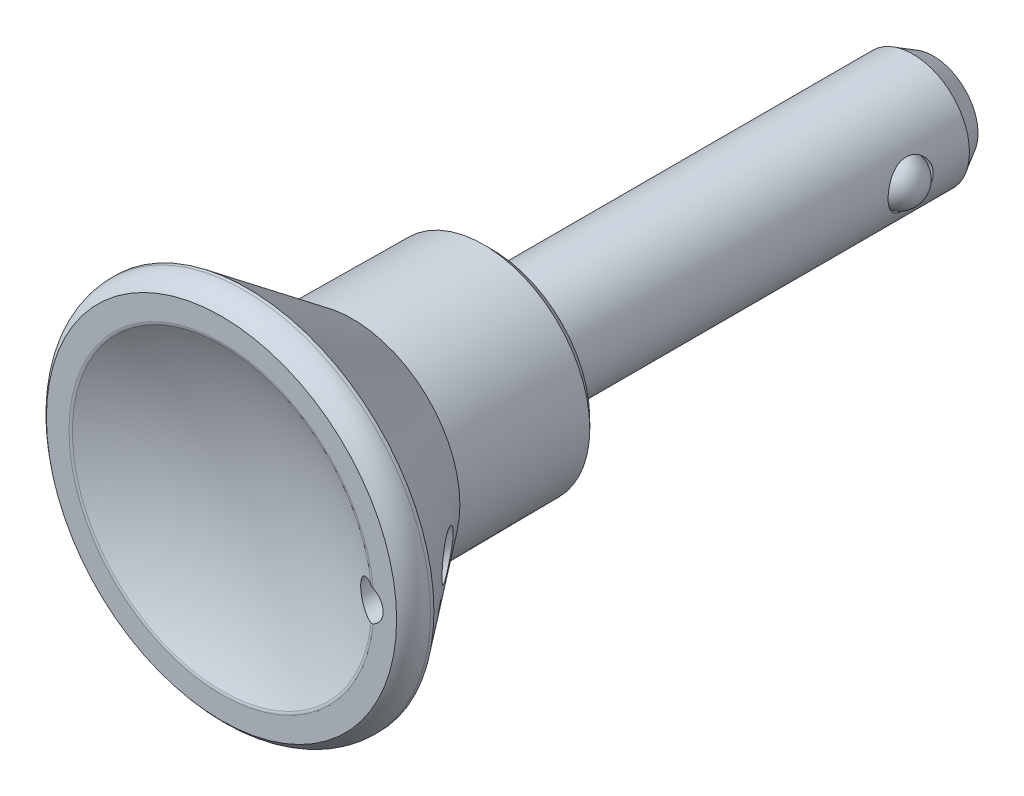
ISO-10303-21;
HEADER;
FILE_DESCRIPTION(('STEP AP214'),'2;1');
FILE_NAME('part.step','',(''),(''),'','','');
FILE_SCHEMA(('AUTOMOTIVE_DESIGN { 1 0 10303 214 1 1 1 1 }'));
ENDSEC;
DATA;
#1=APPLICATION_CONTEXT('core data for automotive mechanical design processes');
#2=APPLICATION_PROTOCOL_DEFINITION('international standard','automotive_design',2000,#1);
#3=PRODUCT_CONTEXT('',#1,'mechanical');
#4=PRODUCT('Part','Part','',(#3));
#5=PRODUCT_RELATED_PRODUCT_CATEGORY('part','',(#4));
#6=PRODUCT_DEFINITION_FORMATION('','',#4);
#7=PRODUCT_DEFINITION_CONTEXT('part definition',#1,'design');
#8=PRODUCT_DEFINITION('design','',#6,#7);
#9=PRODUCT_DEFINITION_SHAPE('','',#8);
#10=(LENGTH_UNIT() NAMED_UNIT(*) SI_UNIT(.MILLI.,.METRE.));
#11=(NAMED_UNIT(*) PLANE_ANGLE_UNIT() SI_UNIT($,.RADIAN.));
#12=(NAMED_UNIT(*) SI_UNIT($,.STERADIAN.) SOLID_ANGLE_UNIT());
#13=UNCERTAINTY_MEASURE_WITH_UNIT(LENGTH_MEASURE(1.E-05),#10,'distance_accuracy_value','');
#14=(GEOMETRIC_REPRESENTATION_CONTEXT(3) GLOBAL_UNCERTAINTY_ASSIGNED_CONTEXT((#13)) GLOBAL_UNIT_ASSIGNED_CONTEXT((#10,
#11,#12)) REPRESENTATION_CONTEXT('',''));
#15=CARTESIAN_POINT('',(0.,0.,0.));
#16=DIRECTION('',(0.,0.,1.));
#17=DIRECTION('',(1.,0.,0.));
#18=AXIS2_PLACEMENT_3D('',#15,#16,#17);
#19=CARTESIAN_POINT('',(0.,0.,23.5));
#20=DIRECTION('',(0.,0.,1.));
#21=DIRECTION('',(0.,-1.,0.));
#22=AXIS2_PLACEMENT_3D('',#19,#20,#21);
#23=TOROIDAL_SURFACE('',#22,13.499629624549,0.50000000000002);
#24=CARTESIAN_POINT('',(13.1832697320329,1.45020836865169,23.940350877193));
#25=CARTESIAN_POINT('',(13.1967898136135,1.44663630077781,23.9473693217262));
#26=CARTESIAN_POINT('',(13.2105528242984,1.44279517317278,23.9537540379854));
#27=CARTESIAN_POINT('',(13.2384329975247,1.43456873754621,23.9652617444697));
#28=CARTESIAN_POINT('',(13.2525500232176,1.43018363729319,23.9703852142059));
#29=CARTESIAN_POINT('',(13.294658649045,1.41639274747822,23.9836925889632));
#30=CARTESIAN_POINT('',(13.322980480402,1.40620303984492,23.9901034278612));
#31=CARTESIAN_POINT('',(13.3645007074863,1.38980064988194,23.9961744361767));
#32=CARTESIAN_POINT('',(13.377775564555,1.38433480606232,23.9976116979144));
#33=CARTESIAN_POINT('',(13.4043485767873,1.37294329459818,23.9995283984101));
#34=CARTESIAN_POINT('',(13.4176457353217,1.3670137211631,23.999998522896));
#35=CARTESIAN_POINT('',(13.430859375,1.3608881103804,24.));
#36=B_SPLINE_CURVE_WITH_KNOTS('',3,(#24,#25,#26,#27,#28,#29,#30,#31,#32,#33,#34,#35),
.UNSPECIFIED.,.F.,.F.,(4,2,2,2,2,4),(0.,0.046898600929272,0.0937793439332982,0.185591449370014,
0.228845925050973,0.272515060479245),.UNSPECIFIED.);
#37=CARTESIAN_POINT('',(13.1832697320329,1.45020836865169,23.940350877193));
#38=VERTEX_POINT('',#37);
#39=CARTESIAN_POINT('',(13.430859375,1.36088811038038,24.));
#40=VERTEX_POINT('',#39);
#41=EDGE_CURVE('E57',#38,#40,#36,.T.);
#42=ORIENTED_EDGE('',*,*,#41,.T.);
#43=CARTESIAN_POINT('',(0.,0.,24.));
#44=DIRECTION('',(0.,0.,1.));
#45=DIRECTION('',(0.,-1.,0.));
#46=AXIS2_PLACEMENT_3D('',#43,#44,#45);
#47=CIRCLE('',#46,13.499629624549);
#48=CARTESIAN_POINT('',(13.430859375,-1.36088811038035,24.));
#49=VERTEX_POINT('',#48);
#50=EDGE_CURVE('E37',#49,#40,#47,.F.);
#51=ORIENTED_EDGE('',*,*,#50,.F.);
#52=CARTESIAN_POINT('',(13.430859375,-1.36088811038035,24.));
#53=CARTESIAN_POINT('',(13.4166665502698,-1.36746807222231,23.9999984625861));
#54=CARTESIAN_POINT('',(13.4023759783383,-1.37382175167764,23.9994558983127));
#55=CARTESIAN_POINT('',(13.3736641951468,-1.38605678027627,23.9972288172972));
#56=CARTESIAN_POINT('',(13.3592428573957,-1.39193760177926,23.9955430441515));
#57=CARTESIAN_POINT('',(13.316571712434,-1.4085689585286,23.9887845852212));
#58=CARTESIAN_POINT('',(13.2882736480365,-1.41860415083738,23.9820148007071));
#59=CARTESIAN_POINT('',(13.2473798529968,-1.43179699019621,23.9685266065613));
#60=CARTESIAN_POINT('',(13.2344037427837,-1.43578270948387,23.9636790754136));
#61=CARTESIAN_POINT('',(13.2086362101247,-1.44332889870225,23.9528611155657));
#62=CARTESIAN_POINT('',(13.1958479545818,-1.44688469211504,23.9468798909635));
#63=CARTESIAN_POINT('',(13.1832697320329,-1.45020836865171,23.940350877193));
#64=B_SPLINE_CURVE_WITH_KNOTS('',3,(#52,#53,#54,#55,#56,#57,#58,#59,#60,#61,#62,#63),
.UNSPECIFIED.,.F.,.F.,(4,2,2,2,2,4),(0.,0.0469051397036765,0.093861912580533,0.185680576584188,
0.228880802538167,0.2725152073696),.UNSPECIFIED.);
#65=CARTESIAN_POINT('',(13.1832697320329,-1.4502083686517,23.940350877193));
#66=VERTEX_POINT('',#65);
#67=EDGE_CURVE('E19',#49,#66,#64,.T.);
#68=ORIENTED_EDGE('',*,*,#67,.T.);
#69=CARTESIAN_POINT('',(0.,0.,23.940350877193));
#70=DIRECTION('',(0.,0.,1.));
#71=DIRECTION('',(0.,-1.,0.));
#72=AXIS2_PLACEMENT_3D('',#69,#70,#71);
#73=CIRCLE('',#72,13.2627940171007);
#74=EDGE_CURVE('E52',#38,#66,#73,.T.);
#75=ORIENTED_EDGE('',*,*,#74,.F.);
#76=EDGE_LOOP('',(#42,#51,#68,#75));
#77=FACE_BOUND('',#76,.T.);
#78=ADVANCED_FACE('F14',(#77),#23,.T.);
#79=CARTESIAN_POINT('',(0.,0.,48.6));
#80=DIRECTION('',(0.,-1.,0.));
#81=DIRECTION('',(0.,0.,1.));
#82=AXIS2_PLACEMENT_3D('',#79,#80,#81);
#83=SPHERICAL_SURFACE('',#82,28.);
#84=CARTESIAN_POINT('',(13.1832697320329,1.45020836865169,23.940350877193));
#85=CARTESIAN_POINT('',(13.0915993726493,1.4744532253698,23.8927620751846));
#86=CARTESIAN_POINT('',(12.9980560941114,1.489860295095,23.8443501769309));
#87=CARTESIAN_POINT('',(12.8097591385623,1.50293318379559,23.7471842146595));
#88=CARTESIAN_POINT('',(12.7150040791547,1.50057651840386,23.6984297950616));
#89=CARTESIAN_POINT('',(12.5270201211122,1.47798913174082,23.6019874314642));
#90=CARTESIAN_POINT('',(12.4337919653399,1.45774995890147,23.5543000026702));
#91=CARTESIAN_POINT('',(12.2517517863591,1.39948117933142,23.4614379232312));
#92=CARTESIAN_POINT('',(12.1629377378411,1.36145981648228,23.416262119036));
#93=CARTESIAN_POINT('',(11.9952411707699,1.26934990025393,23.3311736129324));
#94=CARTESIAN_POINT('',(11.9161458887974,1.21575714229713,23.2911465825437));
#95=CARTESIAN_POINT('',(11.7681643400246,1.09295087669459,23.2164149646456));
#96=CARTESIAN_POINT('',(11.6992729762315,1.02374521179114,23.1817077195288));
#97=CARTESIAN_POINT('',(11.5811025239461,0.878735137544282,23.1222729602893));
#98=CARTESIAN_POINT('',(11.5305709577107,0.804216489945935,23.0969048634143));
#99=CARTESIAN_POINT('',(11.4431131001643,0.645771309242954,23.0530473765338));
#100=CARTESIAN_POINT('',(11.4061726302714,0.561854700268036,23.0345508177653));
#101=CARTESIAN_POINT('',(11.3518094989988,0.398913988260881,23.0073479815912));
#102=CARTESIAN_POINT('',(11.332464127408,0.320688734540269,22.9976766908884));
#103=CARTESIAN_POINT('',(11.3065630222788,0.161638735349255,22.9847305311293));
#104=CARTESIAN_POINT('',(11.3000015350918,0.0808151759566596,22.9814527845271));
#105=CARTESIAN_POINT('',(11.2999985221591,-0.0778011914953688,22.9814513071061));
#106=CARTESIAN_POINT('',(11.3060768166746,-0.155594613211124,22.9844877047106));
#107=CARTESIAN_POINT('',(11.3300927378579,-0.308850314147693,22.9964912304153));
#108=CARTESIAN_POINT('',(11.3480306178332,-0.384312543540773,23.0054584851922));
#109=CARTESIAN_POINT('',(11.3948947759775,-0.530632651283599,23.0289063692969));
#110=CARTESIAN_POINT('',(11.4237977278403,-0.601499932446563,23.0433752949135));
#111=CARTESIAN_POINT('',(11.4913996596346,-0.737094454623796,23.0772561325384));
#112=CARTESIAN_POINT('',(11.5301003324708,-0.801820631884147,23.0966688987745));
#113=CARTESIAN_POINT('',(11.6176766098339,-0.9263609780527,23.1406602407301));
#114=CARTESIAN_POINT('',(11.6669073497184,-0.98586052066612,23.1654195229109));
#115=CARTESIAN_POINT('',(11.7728262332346,-1.09578522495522,23.2187793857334));
#116=CARTESIAN_POINT('',(11.8295165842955,-1.14620769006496,23.2473811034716));
#117=CARTESIAN_POINT('',(11.9547131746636,-1.24189507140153,23.3106654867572));
#118=CARTESIAN_POINT('',(12.0238340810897,-1.28614058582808,23.3456702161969));
#119=CARTESIAN_POINT('',(12.1672246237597,-1.36242212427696,23.4184517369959));
#120=CARTESIAN_POINT('',(12.2414976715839,-1.39444996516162,23.4562303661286));
#121=CARTESIAN_POINT('',(12.3592920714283,-1.4344825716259,23.5162885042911));
#122=CARTESIAN_POINT('',(12.4017101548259,-1.44682505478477,23.5379430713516));
#123=CARTESIAN_POINT('',(12.4872184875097,-1.4676864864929,23.5816530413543));
#124=CARTESIAN_POINT('',(12.5303081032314,-1.47620883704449,23.603708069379));
#125=CARTESIAN_POINT('',(12.6602504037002,-1.49604024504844,23.6703078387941));
#126=CARTESIAN_POINT('',(12.7478240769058,-1.50162964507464,23.7153114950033));
#127=CARTESIAN_POINT('',(12.8938293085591,-1.49821627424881,23.7905484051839));
#128=CARTESIAN_POINT('',(12.9524047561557,-1.49339577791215,23.8207882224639));
#129=CARTESIAN_POINT('',(13.0686394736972,-1.47691090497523,23.8809033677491));
#130=CARTESIAN_POINT('',(13.1263001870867,-1.46525870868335,23.9107792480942));
#131=CARTESIAN_POINT('',(13.1832697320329,-1.4502083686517,23.9403508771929));
#132=B_SPLINE_CURVE_WITH_KNOTS('',3,(#84,#85,#86,#87,#88,#89,#90,#91,#92,#93,#94,#95,#96,#97,
#98,#99,#100,#101,#102,#103,#104,#105,#106,#107,#108,#109,#110,#111,#112,#113,#114,#115,#116,
#117,#118,#119,#120,#121,#122,#123,#124,#125,#126,#127,#128,#129,#130,#131),.UNSPECIFIED.,.F.,
.F.,(4,2,2,2,2,2,2,2,2,2,2,2,2,2,2,2,2,2,2,2,2,2,2,4),(0.,0.317865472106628,0.636133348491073,
0.954551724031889,1.27282262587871,1.58190076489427,1.89082399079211,2.16986616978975,
2.44861641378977,2.69085568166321,2.93298589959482,3.16608592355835,3.39919092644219,
3.63180279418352,3.8644548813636,4.10674626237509,4.34910950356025,4.61569988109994,
4.88246850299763,5.02992533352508,5.17725058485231,5.4717357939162,5.66970066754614,
5.86731365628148),.UNSPECIFIED.);
#133=EDGE_CURVE('E48',#38,#66,#132,.T.);
#134=ORIENTED_EDGE('',*,*,#133,.F.);
#135=ORIENTED_EDGE('',*,*,#74,.T.);
#136=EDGE_LOOP('',(#134,#135));
#137=FACE_BOUND('',#136,.T.);
#138=ADVANCED_FACE('F50',(#137),#83,.F.);
#139=CARTESIAN_POINT('',(-15.81,-15.5,24.));
#140=CARTESIAN_POINT('',(-15.5,-15.5,24.));
#141=CARTESIAN_POINT('',(15.5,-15.5,24.));
#142=B_SPLINE_CURVE_WITH_KNOTS('',1,(#139,#140,#141),.UNSPECIFIED.,.F.,.F.,(2,1,2),(-0.01,0.,
1.),.UNSPECIFIED.);
#143=DIRECTION('',(0.,1.,0.));
#144=VECTOR('',#143,1.);
#145=SURFACE_OF_LINEAR_EXTRUSION('',#142,#144);
#146=CARTESIAN_POINT('',(12.8,0.,24.));
#147=DIRECTION('',(0.,0.,1.));
#148=DIRECTION('',(0.,-1.,0.));
#149=AXIS2_PLACEMENT_3D('',#146,#147,#148);
#150=CIRCLE('',#149,1.5);
#151=EDGE_CURVE('E54',#49,#40,#150,.T.);
#152=ORIENTED_EDGE('',*,*,#151,.F.);
#153=ORIENTED_EDGE('',*,*,#50,.T.);
#154=EDGE_LOOP('',(#152,#153));
#155=FACE_BOUND('',#154,.T.);
#156=CARTESIAN_POINT('',(0.,0.,24.));
#157=DIRECTION('',(0.,0.,1.));
#158=DIRECTION('',(0.,-1.,0.));
#159=AXIS2_PLACEMENT_3D('',#156,#157,#158);
#160=CIRCLE('',#159,15.5);
#161=CARTESIAN_POINT('',(0.,-15.5,24.));
#162=VERTEX_POINT('',#161);
#163=EDGE_CURVE('E55',#162,#162,#160,.F.);
#164=ORIENTED_EDGE('',*,*,#163,.F.);
#165=EDGE_LOOP('',(#164));
#166=FACE_BOUND('',#165,.T.);
#167=ADVANCED_FACE('F179',(#155,#166),#145,.T.);
#168=CARTESIAN_POINT('',(0.,0.,22.));
#169=DIRECTION('',(0.,0.,1.));
#170=DIRECTION('',(0.,-1.,0.));
#171=AXIS2_PLACEMENT_3D('',#168,#169,#170);
#172=TOROIDAL_SURFACE('',#171,14.,2.5);
#173=ORIENTED_EDGE('',*,*,#163,.T.);
#174=EDGE_LOOP('',(#173));
#175=FACE_BOUND('',#174,.T.);
#176=CARTESIAN_POINT('',(0.,0.,22.));
#177=DIRECTION('',(0.,0.,1.));
#178=DIRECTION('',(1.,0.,0.));
#179=AXIS2_PLACEMENT_3D('',#176,#177,#178);
#180=CIRCLE('',#179,16.5);
#181=CARTESIAN_POINT('',(16.5,0.,22.));
#182=VERTEX_POINT('',#181);
#183=EDGE_CURVE('E93',#182,#182,#180,.F.);
#184=ORIENTED_EDGE('',*,*,#183,.F.);
#185=EDGE_LOOP('',(#184));
#186=FACE_BOUND('',#185,.T.);
#187=ADVANCED_FACE('F72',(#175,#186),#172,.T.);
#188=CARTESIAN_POINT('',(12.8,0.,14.7910576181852));
#189=DIRECTION('',(0.,0.,1.));
#190=DIRECTION('',(0.,-1.,0.));
#191=AXIS2_PLACEMENT_3D('',#188,#189,#190);
#192=CYLINDRICAL_SURFACE('',#191,1.5);
#193=CARTESIAN_POINT('',(12.62421875,-1.48966471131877,16.6671130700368));
#194=CARTESIAN_POINT('',(12.6920032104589,-1.49766166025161,16.7577945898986));
#195=CARTESIAN_POINT('',(12.7603283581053,-1.50104579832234,16.8484671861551));
#196=CARTESIAN_POINT('',(12.897645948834,-1.49839397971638,17.0292601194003));
#197=CARTESIAN_POINT('',(12.9666387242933,-1.49235306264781,17.1193801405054));
#198=CARTESIAN_POINT('',(13.1046564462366,-1.47039580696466,17.2982798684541));
#199=CARTESIAN_POINT('',(13.1736813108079,-1.45448817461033,17.3870606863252));
#200=CARTESIAN_POINT('',(13.3110827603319,-1.41207641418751,17.5624849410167));
#201=CARTESIAN_POINT('',(13.3794598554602,-1.38558148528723,17.6491301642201));
#202=CARTESIAN_POINT('',(13.5187485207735,-1.31898430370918,17.8243946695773));
#203=CARTESIAN_POINT('',(13.5895656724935,-1.27816038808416,17.9128199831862));
#204=CARTESIAN_POINT('',(13.7277317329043,-1.18169522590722,18.084148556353));
#205=CARTESIAN_POINT('',(13.7950853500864,-1.12607476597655,18.1670593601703));
#206=CARTESIAN_POINT('',(13.9084086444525,-1.01303116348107,18.3057043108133));
#207=CARTESIAN_POINT('',(13.9556726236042,-0.959133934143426,18.3632332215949));
#208=CARTESIAN_POINT('',(14.0446143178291,-0.840483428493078,18.471045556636));
#209=CARTESIAN_POINT('',(14.0863013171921,-0.775748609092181,18.5213410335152));
#210=CARTESIAN_POINT('',(14.1507925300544,-0.654717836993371,18.5988956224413));
#211=CARTESIAN_POINT('',(14.1756178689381,-0.601120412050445,18.6286642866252));
#212=CARTESIAN_POINT('',(14.2195452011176,-0.488403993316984,18.6812412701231));
#213=CARTESIAN_POINT('',(14.238652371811,-0.429290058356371,18.7040558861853));
#214=CARTESIAN_POINT('',(14.2689681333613,-0.309460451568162,18.7402118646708));
#215=CARTESIAN_POINT('',(14.2805052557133,-0.248950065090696,18.7539474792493));
#216=CARTESIAN_POINT('',(14.2960184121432,-0.12562551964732,18.77240966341));
#217=CARTESIAN_POINT('',(14.3000000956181,-0.0628131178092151,18.7771429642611));
#218=CARTESIAN_POINT('',(14.2999999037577,0.0632231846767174,18.7771427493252));
#219=CARTESIAN_POINT('',(14.2959658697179,0.126447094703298,18.7723472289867));
#220=CARTESIAN_POINT('',(14.2802519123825,0.250551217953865,18.7536458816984));
#221=CARTESIAN_POINT('',(14.2685662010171,0.311429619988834,18.7397331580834));
#222=CARTESIAN_POINT('',(14.2387365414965,0.428564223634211,18.7041556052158));
#223=CARTESIAN_POINT('',(14.2206451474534,0.484853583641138,18.6825538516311));
#224=CARTESIAN_POINT('',(14.1792492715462,0.592453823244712,18.633014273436));
#225=CARTESIAN_POINT('',(14.1559422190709,0.643762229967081,18.6050733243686));
#226=CARTESIAN_POINT('',(14.0931329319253,0.764461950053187,18.5295741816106));
#227=CARTESIAN_POINT('',(14.0512237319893,0.830727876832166,18.4790335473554));
#228=CARTESIAN_POINT('',(13.9615408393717,0.952125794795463,18.370367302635));
#229=CARTESIAN_POINT('',(13.9137529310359,1.00722990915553,18.3122232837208));
#230=CARTESIAN_POINT('',(13.7883270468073,1.13348006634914,18.1588182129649));
#231=CARTESIAN_POINT('',(13.708179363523,1.1978805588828,18.0600849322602));
#232=CARTESIAN_POINT('',(13.5435609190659,1.3064664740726,17.8554996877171));
#233=CARTESIAN_POINT('',(13.4590828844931,1.35061655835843,17.7496356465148));
#234=CARTESIAN_POINT('',(13.3107013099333,1.41202717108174,17.5619635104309));
#235=CARTESIAN_POINT('',(13.2471965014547,1.43330058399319,17.4811068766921));
#236=CARTESIAN_POINT('',(13.1198264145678,1.46698834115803,17.3177942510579));
#237=CARTESIAN_POINT('',(13.0559609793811,1.47939847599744,17.2353375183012));
#238=CARTESIAN_POINT('',(12.9282718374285,1.49589397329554,17.0692879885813));
#239=CARTESIAN_POINT('',(12.8644485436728,1.49996064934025,16.9856930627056));
#240=CARTESIAN_POINT('',(12.7374091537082,1.5000387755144,16.8180712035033));
#241=CARTESIAN_POINT('',(12.6741929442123,1.49605175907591,16.7340443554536));
#242=CARTESIAN_POINT('',(12.5469978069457,1.47993658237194,16.5637117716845));
#243=CARTESIAN_POINT('',(12.4830456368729,1.46758777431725,16.4774068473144));
#244=CARTESIAN_POINT('',(12.3565302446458,1.43443826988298,16.3053467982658));
#245=CARTESIAN_POINT('',(12.2939675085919,1.41363466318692,16.2195918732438));
#246=CARTESIAN_POINT('',(12.1709555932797,1.36334219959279,16.0496685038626));
#247=CARTESIAN_POINT('',(12.1104987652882,1.33388949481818,15.9654949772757));
#248=CARTESIAN_POINT('',(11.9920388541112,1.26565016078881,15.7992974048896));
#249=CARTESIAN_POINT('',(11.9340336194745,1.2268719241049,15.7172714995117));
#250=CARTESIAN_POINT('',(11.8266654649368,1.14315320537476,15.5643050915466));
#251=CARTESIAN_POINT('',(11.7770073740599,1.09916121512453,15.4930561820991));
#252=CARTESIAN_POINT('',(11.6811267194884,1.0014126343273,15.3545942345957));
#253=CARTESIAN_POINT('',(11.6349116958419,0.947635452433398,15.2873901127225));
#254=CARTESIAN_POINT('',(11.5691423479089,0.858125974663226,15.1911821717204));
#255=CARTESIAN_POINT('',(11.5476572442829,0.826531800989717,15.1596504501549));
#256=CARTESIAN_POINT('',(11.5063433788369,0.760253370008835,15.0988444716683));
#257=CARTESIAN_POINT('',(11.4865152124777,0.725568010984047,15.0695710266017));
#258=CARTESIAN_POINT('',(11.4302732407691,0.616814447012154,14.9863165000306));
#259=CARTESIAN_POINT('',(11.3967954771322,0.537651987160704,14.9364517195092));
#260=CARTESIAN_POINT('',(11.3555291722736,0.407099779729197,14.8747804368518));
#261=CARTESIAN_POINT('',(11.3430899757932,0.360365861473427,14.856144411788));
#262=CARTESIAN_POINT('',(11.3225831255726,0.263914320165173,14.8253840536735));
#263=CARTESIAN_POINT('',(11.3145046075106,0.214204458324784,14.8132435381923));
#264=CARTESIAN_POINT('',(11.3059949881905,0.136701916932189,14.8004485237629));
#265=CARTESIAN_POINT('',(11.3037543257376,0.109528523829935,14.7970776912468));
#266=CARTESIAN_POINT('',(11.300755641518,0.0549082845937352,14.7925658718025));
#267=CARTESIAN_POINT('',(11.2999979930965,0.0274613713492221,14.791425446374));
#268=CARTESIAN_POINT('',(11.3000036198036,-0.0495314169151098,14.7914342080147));
#269=CARTESIAN_POINT('',(11.3024785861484,-0.0991098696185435,14.7951600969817));
#270=CARTESIAN_POINT('',(11.3121472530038,-0.196763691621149,14.8096998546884));
#271=CARTESIAN_POINT('',(11.3193489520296,-0.244836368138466,14.8205257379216));
#272=CARTESIAN_POINT('',(11.3399096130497,-0.348584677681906,14.851379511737));
#273=CARTESIAN_POINT('',(11.3542736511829,-0.403610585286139,14.8729064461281));
#274=CARTESIAN_POINT('',(11.387815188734,-0.50871821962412,14.9230284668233));
#275=CARTESIAN_POINT('',(11.4070004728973,-0.558791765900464,14.9516349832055));
#276=CARTESIAN_POINT('',(11.4595328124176,-0.677671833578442,15.0296959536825));
#277=CARTESIAN_POINT('',(11.4951602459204,-0.74330038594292,15.0824162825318));
#278=CARTESIAN_POINT('',(11.5718624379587,-0.864190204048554,15.1952386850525));
#279=CARTESIAN_POINT('',(11.6129512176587,-0.919423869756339,15.2553597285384));
#280=CARTESIAN_POINT('',(11.6921657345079,-1.01283475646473,15.3705343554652));
#281=CARTESIAN_POINT('',(11.7297508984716,-1.05232856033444,15.4249113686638));
#282=CARTESIAN_POINT('',(11.8070065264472,-1.12552131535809,15.5360737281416));
#283=CARTESIAN_POINT('',(11.8466784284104,-1.15921620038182,15.5928607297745));
#284=CARTESIAN_POINT('',(11.9276586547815,-1.22132048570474,15.7081342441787));
#285=CARTESIAN_POINT('',(11.9689673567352,-1.24972865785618,15.7666211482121));
#286=CARTESIAN_POINT('',(12.0529136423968,-1.30165144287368,15.884812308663));
#287=CARTESIAN_POINT('',(12.0955516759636,-1.32516437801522,15.9445169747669));
#288=CARTESIAN_POINT('',(12.2167649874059,-1.38470455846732,16.1132939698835));
#289=CARTESIAN_POINT('',(12.2965837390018,-1.41552588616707,16.2233378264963));
#290=CARTESIAN_POINT('',(12.458735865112,-1.46310486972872,16.4446295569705));
#291=CARTESIAN_POINT('',(12.5410705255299,-1.47985520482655,16.5558780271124));
#292=CARTESIAN_POINT('',(12.62421875,-1.48966471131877,16.6671130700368));
#293=B_SPLINE_CURVE_WITH_KNOTS('',3,(#193,#194,#195,#196,#197,#198,#199,#200,#201,#202,#203,
#204,#205,#206,#207,#208,#209,#210,#211,#212,#213,#214,#215,#216,#217,#218,#219,#220,#221,#222,
#223,#224,#225,#226,#227,#228,#229,#230,#231,#232,#233,#234,#235,#236,#237,#238,#239,#240,#241,
#242,#243,#244,#245,#246,#247,#248,#249,#250,#251,#252,#253,#254,#255,#256,#257,#258,#259,#260,
#261,#262,#263,#264,#265,#266,#267,#268,#269,#270,#271,#272,#273,#274,#275,#276,#277,#278,#279,
#280,#281,#282,#283,#284,#285,#286,#287,#288,#289,#290,#291,#292),.UNSPECIFIED.,.T.,.F.,(4,2,2,
2,2,2,2,2,2,2,2,2,2,2,2,2,2,2,2,2,2,2,2,2,2,2,2,2,2,2,2,2,2,2,2,2,2,2,2,2,2,2,2,2,2,2,2,2,2,4),
(0.,0.3403810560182,0.680941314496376,1.02120149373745,1.36116666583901,1.72154948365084,
2.08142867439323,2.35634247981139,2.63079277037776,2.82853330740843,3.02609425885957,
3.21438583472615,3.40253656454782,3.59191561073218,3.78143807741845,3.96944036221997,
4.15753551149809,4.43581804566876,4.71478725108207,5.14007838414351,5.56610888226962,
5.88069336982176,6.19542716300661,6.51086508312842,6.82624294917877,7.15028500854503,
7.47443870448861,7.79725631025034,8.11978447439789,8.41136093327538,8.70355821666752,
8.8520054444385,9.00050579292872,9.29551066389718,9.45047012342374,9.60504170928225,
9.68734372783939,9.76966646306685,9.91815000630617,10.0668854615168,10.2482950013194,
10.4299993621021,10.702706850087,10.9761285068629,11.2068168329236,11.4376662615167,
11.6685692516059,11.8995512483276,12.3168647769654,12.7343952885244),.UNSPECIFIED.);
#294=CARTESIAN_POINT('',(12.62421875,-1.48966471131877,16.6671130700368));
#295=VERTEX_POINT('',#294);
#296=EDGE_CURVE('E86',#295,#295,#293,.T.);
#297=ORIENTED_EDGE('',*,*,#296,.F.);
#298=EDGE_LOOP('',(#297));
#299=FACE_BOUND('',#298,.T.);
#300=ORIENTED_EDGE('',*,*,#67,.F.);
#301=ORIENTED_EDGE('',*,*,#151,.T.);
#302=ORIENTED_EDGE('',*,*,#41,.F.);
#303=ORIENTED_EDGE('',*,*,#133,.T.);
#304=EDGE_LOOP('',(#300,#301,#302,#303));
#305=FACE_BOUND('',#304,.T.);
#306=ADVANCED_FACE('F58',(#299,#305),#192,.F.);
#307=CARTESIAN_POINT('',(0.,0.,22.));
#308=DIRECTION('',(0.,0.,1.));
#309=DIRECTION('',(0.,-1.,0.));
#310=AXIS2_PLACEMENT_3D('',#307,#308,#309);
#311=CYLINDRICAL_SURFACE('',#310,16.5);
#312=ORIENTED_EDGE('',*,*,#183,.T.);
#313=EDGE_LOOP('',(#312));
#314=FACE_BOUND('',#313,.T.);
#315=CARTESIAN_POINT('',(0.,0.,21.7));
#316=DIRECTION('',(0.,0.,-1.));
#317=DIRECTION('',(1.,0.,0.));
#318=AXIS2_PLACEMENT_3D('',#315,#316,#317);
#319=CIRCLE('',#318,16.5);
#320=CARTESIAN_POINT('',(16.5,0.,21.7));
#321=VERTEX_POINT('',#320);
#322=EDGE_CURVE('E92',#321,#321,#319,.T.);
#323=ORIENTED_EDGE('',*,*,#322,.F.);
#324=EDGE_LOOP('',(#323));
#325=FACE_BOUND('',#324,.T.);
#326=ADVANCED_FACE('F71',(#314,#325),#311,.T.);
#327=CARTESIAN_POINT('',(0.,0.,12.4));
#328=DIRECTION('',(0.,0.,1.));
#329=DIRECTION('',(0.,-1.,0.));
#330=AXIS2_PLACEMENT_3D('',#327,#328,#329);
#331=CONICAL_SURFACE('',#330,9.5,0.645219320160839);
#332=ORIENTED_EDGE('',*,*,#296,.T.);
#333=EDGE_LOOP('',(#332));
#334=FACE_BOUND('',#333,.T.);
#335=ORIENTED_EDGE('',*,*,#322,.T.);
#336=EDGE_LOOP('',(#335));
#337=FACE_BOUND('',#336,.T.);
#338=CARTESIAN_POINT('',(0.,0.,12.4));
#339=DIRECTION('',(0.,0.,-1.));
#340=DIRECTION('',(1.,0.,0.));
#341=AXIS2_PLACEMENT_3D('',#338,#339,#340);
#342=CIRCLE('',#341,9.5);
#343=CARTESIAN_POINT('',(9.5,0.,12.4));
#344=VERTEX_POINT('',#343);
#345=EDGE_CURVE('E163',#344,#344,#342,.T.);
#346=ORIENTED_EDGE('',*,*,#345,.F.);
#347=EDGE_LOOP('',(#346));
#348=FACE_BOUND('',#347,.T.);
#349=ADVANCED_FACE('F94',(#334,#337,#348),#331,.T.);
#350=CARTESIAN_POINT('',(0.,0.,0.799969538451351));
#351=DIRECTION('',(0.,0.,1.));
#352=DIRECTION('',(0.,-1.,0.));
#353=AXIS2_PLACEMENT_3D('',#350,#351,#352);
#354=CONICAL_SURFACE('',#353,9.39876806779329,0.00872664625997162);
#355=ORIENTED_EDGE('',*,*,#345,.T.);
#356=EDGE_LOOP('',(#355));
#357=FACE_BOUND('',#356,.T.);
#358=CARTESIAN_POINT('',(0.,0.,0.799969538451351));
#359=DIRECTION('',(0.,0.,-1.));
#360=DIRECTION('',(1.,0.,0.));
#361=AXIS2_PLACEMENT_3D('',#358,#359,#360);
#362=CIRCLE('',#361,9.39876806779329);
#363=CARTESIAN_POINT('',(9.39876806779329,0.,0.799969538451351));
#364=VERTEX_POINT('',#363);
#365=EDGE_CURVE('E160',#364,#364,#362,.T.);
#366=ORIENTED_EDGE('',*,*,#365,.F.);
#367=EDGE_LOOP('',(#366));
#368=FACE_BOUND('',#367,.T.);
#369=ADVANCED_FACE('F98',(#357,#368),#354,.T.);
#370=CARTESIAN_POINT('',(0.,0.,0.));
#371=DIRECTION('',(0.,0.,1.));
#372=DIRECTION('',(0.,-1.,0.));
#373=AXIS2_PLACEMENT_3D('',#370,#371,#372);
#374=CONICAL_SURFACE('',#373,8.59178683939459,0.789761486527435);
#375=ORIENTED_EDGE('',*,*,#365,.T.);
#376=EDGE_LOOP('',(#375));
#377=FACE_BOUND('',#376,.T.);
#378=CARTESIAN_POINT('',(0.,0.,0.));
#379=DIRECTION('',(0.,0.,1.));
#380=DIRECTION('',(0.,-1.,0.));
#381=AXIS2_PLACEMENT_3D('',#378,#379,#380);
#382=CIRCLE('',#381,8.59178683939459);
#383=CARTESIAN_POINT('',(0.,-8.59178683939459,0.));
#384=VERTEX_POINT('',#383);
#385=EDGE_CURVE('E30',#384,#384,#382,.F.);
#386=ORIENTED_EDGE('',*,*,#385,.F.);
#387=EDGE_LOOP('',(#386));
#388=FACE_BOUND('',#387,.T.);
#389=ADVANCED_FACE('F102',(#377,#388),#374,.T.);
#390=CARTESIAN_POINT('',(8.5917868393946,-8.69489038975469,0.));
#391=DIRECTION('',(0.,0.,-1.));
#392=DIRECTION('',(-1.,0.,0.));
#393=AXIS2_PLACEMENT_3D('',#390,#391,#392);
#394=PLANE('',#393);
#395=CARTESIAN_POINT('',(0.,0.,0.));
#396=DIRECTION('',(0.,0.,1.));
#397=DIRECTION('',(0.,-1.,0.));
#398=AXIS2_PLACEMENT_3D('',#395,#396,#397);
#399=CIRCLE('',#398,5.);
#400=CARTESIAN_POINT('',(0.,-5.,0.));
#401=VERTEX_POINT('',#400);
#402=EDGE_CURVE('E9',#401,#401,#399,.F.);
#403=ORIENTED_EDGE('',*,*,#402,.F.);
#404=EDGE_LOOP('',(#403));
#405=FACE_BOUND('',#404,.T.);
#406=ORIENTED_EDGE('',*,*,#385,.T.);
#407=EDGE_LOOP('',(#406));
#408=FACE_BOUND('',#407,.T.);
#409=ADVANCED_FACE('F106',(#405,#408),#394,.T.);
#410=CARTESIAN_POINT('',(0.,0.,0.));
#411=DIRECTION('',(0.,0.,1.));
#412=DIRECTION('',(0.,-1.,0.));
#413=AXIS2_PLACEMENT_3D('',#410,#411,#412);
#414=CYLINDRICAL_SURFACE('',#413,5.);
#415=ORIENTED_EDGE('',*,*,#402,.T.);
#416=EDGE_LOOP('',(#415));
#417=FACE_BOUND('',#416,.T.);
#418=CARTESIAN_POINT('',(5.,0.,-30.));
#419=CARTESIAN_POINT('',(4.99999504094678,0.107615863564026,-30.0000062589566));
#420=CARTESIAN_POINT('',(4.99648897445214,0.215325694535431,-30.0087281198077));
#421=CARTESIAN_POINT('',(4.98282088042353,0.427616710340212,-30.0432818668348));
#422=CARTESIAN_POINT('',(4.97264930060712,0.532193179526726,-30.0691383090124));
#423=CARTESIAN_POINT('',(4.94674442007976,0.734940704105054,-30.1368701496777));
#424=CARTESIAN_POINT('',(4.93102668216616,0.83312878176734,-30.1787007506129));
#425=CARTESIAN_POINT('',(4.89557266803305,1.02104090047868,-30.2770003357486));
#426=CARTESIAN_POINT('',(4.87583644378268,1.11076505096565,-30.3334691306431));
#427=CARTESIAN_POINT('',(4.83330802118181,1.2835047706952,-30.4622380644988));
#428=CARTESIAN_POINT('',(4.8104211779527,1.36606882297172,-30.5351123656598));
#429=CARTESIAN_POINT('',(4.76460397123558,1.51818036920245,-30.6934066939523));
#430=CARTESIAN_POINT('',(4.74167359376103,1.58772251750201,-30.7788318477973));
#431=CARTESIAN_POINT('',(4.69722807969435,1.71487412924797,-30.9644273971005));
#432=CARTESIAN_POINT('',(4.67582146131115,1.77181418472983,-31.0650850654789));
#433=CARTESIAN_POINT('',(4.63833669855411,1.86775416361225,-31.2755348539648));
#434=CARTESIAN_POINT('',(4.62225609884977,1.90676235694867,-31.3853227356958));
#435=CARTESIAN_POINT('',(4.59826357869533,1.96389881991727,-31.6057123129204));
#436=CARTESIAN_POINT('',(4.59001420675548,1.98289395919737,-31.7160511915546));
#437=CARTESIAN_POINT('',(4.58164004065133,2.00217296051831,-31.9386349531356));
#438=CARTESIAN_POINT('',(4.5815112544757,2.0024660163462,-32.0508788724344));
#439=CARTESIAN_POINT('',(4.58910500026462,1.98498937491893,-32.2657566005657));
#440=CARTESIAN_POINT('',(4.59628174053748,1.96847534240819,-32.3685155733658));
#441=CARTESIAN_POINT('',(4.61676185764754,1.91994691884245,-32.5696594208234));
#442=CARTESIAN_POINT('',(4.63006631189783,1.88792980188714,-32.6680435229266));
#443=CARTESIAN_POINT('',(4.66159517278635,1.80869394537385,-32.8600197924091));
#444=CARTESIAN_POINT('',(4.67991453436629,1.7611780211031,-32.9534730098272));
#445=CARTESIAN_POINT('',(4.71938201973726,1.65250390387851,-33.1314192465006));
#446=CARTESIAN_POINT('',(4.74053109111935,1.59134113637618,-33.2159092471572));
#447=CARTESIAN_POINT('',(4.78526406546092,1.45156124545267,-33.3803975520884));
#448=CARTESIAN_POINT('',(4.80890991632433,1.37196139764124,-33.4595460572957));
#449=CARTESIAN_POINT('',(4.8545919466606,1.20033946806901,-33.6036660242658));
#450=CARTESIAN_POINT('',(4.87662734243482,1.10831139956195,-33.6686306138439));
#451=CARTESIAN_POINT('',(4.91716230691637,0.91200742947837,-33.7836609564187));
#452=CARTESIAN_POINT('',(4.93558065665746,0.807520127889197,-33.8333960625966));
#453=CARTESIAN_POINT('',(4.96616672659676,0.590835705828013,-33.9142166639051));
#454=CARTESIAN_POINT('',(4.97834697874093,0.478654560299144,-33.9453395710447));
#455=CARTESIAN_POINT('',(4.99108567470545,0.304486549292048,-33.9776312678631));
#456=CARTESIAN_POINT('',(4.99441629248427,0.243952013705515,-33.9860060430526));
#457=CARTESIAN_POINT('',(4.99887485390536,0.122288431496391,-33.9971921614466));
#458=CARTESIAN_POINT('',(5.00000281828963,0.0611593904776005,-34.0000035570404));
#459=CARTESIAN_POINT('',(4.99999504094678,-0.107615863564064,-33.9999937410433));
#460=CARTESIAN_POINT('',(4.99648897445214,-0.215325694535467,-33.9912718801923));
#461=CARTESIAN_POINT('',(4.98282088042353,-0.427616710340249,-33.9567181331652));
#462=CARTESIAN_POINT('',(4.97264930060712,-0.532193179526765,-33.9308616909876));
#463=CARTESIAN_POINT('',(4.94674442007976,-0.734940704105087,-33.8631298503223));
#464=CARTESIAN_POINT('',(4.93102668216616,-0.833128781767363,-33.8212992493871));
#465=CARTESIAN_POINT('',(4.89557266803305,-1.0210409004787,-33.7229996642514));
#466=CARTESIAN_POINT('',(4.87583644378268,-1.11076505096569,-33.6665308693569));
#467=CARTESIAN_POINT('',(4.83330802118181,-1.28350477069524,-33.5377619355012));
#468=CARTESIAN_POINT('',(4.81042117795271,-1.36606882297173,-33.4648876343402));
#469=CARTESIAN_POINT('',(4.76460397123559,-1.51818036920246,-33.3065933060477));
#470=CARTESIAN_POINT('',(4.74167359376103,-1.58772251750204,-33.2211681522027));
#471=CARTESIAN_POINT('',(4.69722807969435,-1.71487412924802,-33.0355726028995));
#472=CARTESIAN_POINT('',(4.67582146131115,-1.77181418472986,-32.9349149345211));
#473=CARTESIAN_POINT('',(4.63833669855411,-1.86775416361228,-32.7244651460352));
#474=CARTESIAN_POINT('',(4.62225609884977,-1.90676235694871,-32.6146772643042));
#475=CARTESIAN_POINT('',(4.59826357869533,-1.96389881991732,-32.3942876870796));
#476=CARTESIAN_POINT('',(4.59001420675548,-1.98289395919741,-32.2839488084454));
#477=CARTESIAN_POINT('',(4.58164004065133,-2.00217296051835,-32.0613650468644));
#478=CARTESIAN_POINT('',(4.5815112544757,-2.00246601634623,-31.9491211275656));
#479=CARTESIAN_POINT('',(4.58910500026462,-1.98498937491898,-31.7342433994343));
#480=CARTESIAN_POINT('',(4.59628174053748,-1.96847534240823,-31.6314844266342));
#481=CARTESIAN_POINT('',(4.61676185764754,-1.91994691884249,-31.4303405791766));
#482=CARTESIAN_POINT('',(4.63006631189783,-1.88792980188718,-31.3319564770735));
#483=CARTESIAN_POINT('',(4.66159517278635,-1.8086939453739,-31.1399802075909));
#484=CARTESIAN_POINT('',(4.67991453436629,-1.76117802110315,-31.0465269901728));
#485=CARTESIAN_POINT('',(4.71938201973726,-1.65250390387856,-30.8685807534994));
#486=CARTESIAN_POINT('',(4.74053109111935,-1.59134113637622,-30.7840907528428));
#487=CARTESIAN_POINT('',(4.78526406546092,-1.45156124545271,-30.6196024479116));
#488=CARTESIAN_POINT('',(4.80890991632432,-1.37196139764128,-30.5404539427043));
#489=CARTESIAN_POINT('',(4.8545919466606,-1.20033946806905,-30.3963339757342));
#490=CARTESIAN_POINT('',(4.87662734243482,-1.10831139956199,-30.3313693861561));
#491=CARTESIAN_POINT('',(4.91716230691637,-0.912007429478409,-30.2163390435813));
#492=CARTESIAN_POINT('',(4.93558065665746,-0.807520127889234,-30.1666039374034));
#493=CARTESIAN_POINT('',(4.96616672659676,-0.590835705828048,-30.0857833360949));
#494=CARTESIAN_POINT('',(4.97834697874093,-0.47865456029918,-30.0546604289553));
#495=CARTESIAN_POINT('',(4.99108567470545,-0.304486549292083,-30.0223687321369));
#496=CARTESIAN_POINT('',(4.99441629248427,-0.24395201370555,-30.0139939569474));
#497=CARTESIAN_POINT('',(4.99887485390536,-0.122288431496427,-30.0028078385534));
#498=CARTESIAN_POINT('',(5.00000281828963,-0.0611593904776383,-29.9999964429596));
#499=CARTESIAN_POINT('',(5.,0.,-30.));
#500=B_SPLINE_CURVE_WITH_KNOTS('',3,(#418,#419,#420,#421,#422,#423,#424,#425,#426,#427,#428,
#429,#430,#431,#432,#433,#434,#435,#436,#437,#438,#439,#440,#441,#442,#443,#444,#445,#446,#447,
#448,#449,#450,#451,#452,#453,#454,#455,#456,#457,#458,#459,#460,#461,#462,#463,#464,#465,#466,
#467,#468,#469,#470,#471,#472,#473,#474,#475,#476,#477,#478,#479,#480,#481,#482,#483,#484,#485,
#486,#487,#488,#489,#490,#491,#492,#493,#494,#495,#496,#497,#498,#499),.UNSPECIFIED.,.T.,.F.,(4,
2,2,2,2,2,2,2,2,2,2,2,2,2,2,2,2,2,2,2,2,2,2,2,2,2,2,2,2,2,2,2,2,2,2,2,2,2,2,2,4),(0.,
0.322610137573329,0.645683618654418,0.967857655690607,1.2900275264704,1.62598692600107,
1.96208394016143,2.31315011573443,2.66405422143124,2.99904097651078,3.33386305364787,
3.6453830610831,3.95695786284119,4.27489766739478,4.59294420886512,4.93553475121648,
5.27829091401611,5.62803295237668,5.9770695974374,6.16041454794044,6.34375777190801,
6.66636790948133,6.98944139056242,7.3116154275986,7.63378529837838,7.96974469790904,
8.30584171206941,8.65690788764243,9.00781199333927,9.34279874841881,9.6776208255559,
9.9891408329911,10.3007156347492,10.6186554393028,10.9367019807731,11.2792925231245,
11.6220486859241,11.9717907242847,12.3208273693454,12.5041723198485,12.687515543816),.UNSPECIFIED.);
#501=CARTESIAN_POINT('',(5.,0.,-30.));
#502=VERTEX_POINT('',#501);
#503=EDGE_CURVE('E123',#502,#502,#500,.T.);
#504=ORIENTED_EDGE('',*,*,#503,.T.);
#505=EDGE_LOOP('',(#504));
#506=FACE_BOUND('',#505,.T.);
#507=CARTESIAN_POINT('',(-5.,0.,-30.));
#508=CARTESIAN_POINT('',(-4.99999504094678,0.107615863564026,-30.0000062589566));
#509=CARTESIAN_POINT('',(-4.99648897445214,0.215325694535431,-30.0087281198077));
#510=CARTESIAN_POINT('',(-4.98282088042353,0.427616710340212,-30.0432818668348));
#511=CARTESIAN_POINT('',(-4.97264930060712,0.532193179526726,-30.0691383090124));
#512=CARTESIAN_POINT('',(-4.94674442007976,0.734940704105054,-30.1368701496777));
#513=CARTESIAN_POINT('',(-4.93102668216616,0.83312878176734,-30.1787007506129));
#514=CARTESIAN_POINT('',(-4.89557266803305,1.02104090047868,-30.2770003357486));
#515=CARTESIAN_POINT('',(-4.87583644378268,1.11076505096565,-30.3334691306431));
#516=CARTESIAN_POINT('',(-4.83330802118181,1.2835047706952,-30.4622380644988));
#517=CARTESIAN_POINT('',(-4.8104211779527,1.36606882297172,-30.5351123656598));
#518=CARTESIAN_POINT('',(-4.76460397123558,1.51818036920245,-30.6934066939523));
#519=CARTESIAN_POINT('',(-4.74167359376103,1.58772251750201,-30.7788318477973));
#520=CARTESIAN_POINT('',(-4.69722807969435,1.71487412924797,-30.9644273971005));
#521=CARTESIAN_POINT('',(-4.67582146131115,1.77181418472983,-31.0650850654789));
#522=CARTESIAN_POINT('',(-4.63833669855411,1.86775416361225,-31.2755348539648));
#523=CARTESIAN_POINT('',(-4.62225609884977,1.90676235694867,-31.3853227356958));
#524=CARTESIAN_POINT('',(-4.59826357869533,1.96389881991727,-31.6057123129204));
#525=CARTESIAN_POINT('',(-4.59001420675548,1.98289395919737,-31.7160511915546));
#526=CARTESIAN_POINT('',(-4.58164004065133,2.00217296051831,-31.9386349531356));
#527=CARTESIAN_POINT('',(-4.5815112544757,2.0024660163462,-32.0508788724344));
#528=CARTESIAN_POINT('',(-4.58910500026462,1.98498937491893,-32.2657566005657));
#529=CARTESIAN_POINT('',(-4.59628174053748,1.96847534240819,-32.3685155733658));
#530=CARTESIAN_POINT('',(-4.61676185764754,1.91994691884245,-32.5696594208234));
#531=CARTESIAN_POINT('',(-4.63006631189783,1.88792980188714,-32.6680435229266));
#532=CARTESIAN_POINT('',(-4.66159517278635,1.80869394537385,-32.8600197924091));
#533=CARTESIAN_POINT('',(-4.67991453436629,1.7611780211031,-32.9534730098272));
#534=CARTESIAN_POINT('',(-4.71938201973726,1.65250390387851,-33.1314192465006));
#535=CARTESIAN_POINT('',(-4.74053109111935,1.59134113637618,-33.2159092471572));
#536=CARTESIAN_POINT('',(-4.78526406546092,1.45156124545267,-33.3803975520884));
#537=CARTESIAN_POINT('',(-4.80890991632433,1.37196139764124,-33.4595460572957));
#538=CARTESIAN_POINT('',(-4.8545919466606,1.20033946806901,-33.6036660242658));
#539=CARTESIAN_POINT('',(-4.87662734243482,1.10831139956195,-33.6686306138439));
#540=CARTESIAN_POINT('',(-4.91716230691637,0.91200742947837,-33.7836609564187));
#541=CARTESIAN_POINT('',(-4.93558065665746,0.807520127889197,-33.8333960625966));
#542=CARTESIAN_POINT('',(-4.96616672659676,0.590835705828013,-33.9142166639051));
#543=CARTESIAN_POINT('',(-4.97834697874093,0.478654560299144,-33.9453395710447));
#544=CARTESIAN_POINT('',(-4.99108567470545,0.304486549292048,-33.9776312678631));
#545=CARTESIAN_POINT('',(-4.99441629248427,0.243952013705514,-33.9860060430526));
#546=CARTESIAN_POINT('',(-4.99887485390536,0.122288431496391,-33.9971921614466));
#547=CARTESIAN_POINT('',(-5.00000281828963,0.061159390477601,-34.0000035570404));
#548=CARTESIAN_POINT('',(-4.99999504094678,-0.107615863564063,-33.9999937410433));
#549=CARTESIAN_POINT('',(-4.99648897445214,-0.215325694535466,-33.9912718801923));
#550=CARTESIAN_POINT('',(-4.98282088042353,-0.427616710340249,-33.9567181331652));
#551=CARTESIAN_POINT('',(-4.97264930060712,-0.532193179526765,-33.9308616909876));
#552=CARTESIAN_POINT('',(-4.94674442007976,-0.734940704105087,-33.8631298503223));
#553=CARTESIAN_POINT('',(-4.93102668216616,-0.833128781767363,-33.8212992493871));
#554=CARTESIAN_POINT('',(-4.89557266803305,-1.0210409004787,-33.7229996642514));
#555=CARTESIAN_POINT('',(-4.87583644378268,-1.11076505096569,-33.6665308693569));
#556=CARTESIAN_POINT('',(-4.83330802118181,-1.28350477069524,-33.5377619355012));
#557=CARTESIAN_POINT('',(-4.81042117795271,-1.36606882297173,-33.4648876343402));
#558=CARTESIAN_POINT('',(-4.76460397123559,-1.51818036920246,-33.3065933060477));
#559=CARTESIAN_POINT('',(-4.74167359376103,-1.58772251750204,-33.2211681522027));
#560=CARTESIAN_POINT('',(-4.69722807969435,-1.71487412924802,-33.0355726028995));
#561=CARTESIAN_POINT('',(-4.67582146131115,-1.77181418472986,-32.9349149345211));
#562=CARTESIAN_POINT('',(-4.63833669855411,-1.86775416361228,-32.7244651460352));
#563=CARTESIAN_POINT('',(-4.62225609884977,-1.9067623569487,-32.6146772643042));
#564=CARTESIAN_POINT('',(-4.59826357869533,-1.96389881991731,-32.3942876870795));
#565=CARTESIAN_POINT('',(-4.59001420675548,-1.98289395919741,-32.2839488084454));
#566=CARTESIAN_POINT('',(-4.58164004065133,-2.00217296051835,-32.0613650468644));
#567=CARTESIAN_POINT('',(-4.5815112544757,-2.00246601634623,-31.9491211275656));
#568=CARTESIAN_POINT('',(-4.58910500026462,-1.98498937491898,-31.7342433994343));
#569=CARTESIAN_POINT('',(-4.59628174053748,-1.96847534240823,-31.6314844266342));
#570=CARTESIAN_POINT('',(-4.61676185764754,-1.91994691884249,-31.4303405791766));
#571=CARTESIAN_POINT('',(-4.63006631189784,-1.88792980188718,-31.3319564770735));
#572=CARTESIAN_POINT('',(-4.66159517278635,-1.8086939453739,-31.1399802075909));
#573=CARTESIAN_POINT('',(-4.67991453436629,-1.76117802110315,-31.0465269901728));
#574=CARTESIAN_POINT('',(-4.71938201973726,-1.65250390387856,-30.8685807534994));
#575=CARTESIAN_POINT('',(-4.74053109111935,-1.59134113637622,-30.7840907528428));
#576=CARTESIAN_POINT('',(-4.78526406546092,-1.45156124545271,-30.6196024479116));
#577=CARTESIAN_POINT('',(-4.80890991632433,-1.37196139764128,-30.5404539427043));
#578=CARTESIAN_POINT('',(-4.8545919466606,-1.20033946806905,-30.3963339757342));
#579=CARTESIAN_POINT('',(-4.87662734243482,-1.10831139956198,-30.3313693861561));
#580=CARTESIAN_POINT('',(-4.91716230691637,-0.912007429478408,-30.2163390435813));
#581=CARTESIAN_POINT('',(-4.93558065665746,-0.807520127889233,-30.1666039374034));
#582=CARTESIAN_POINT('',(-4.96616672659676,-0.590835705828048,-30.0857833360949));
#583=CARTESIAN_POINT('',(-4.97834697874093,-0.478654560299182,-30.0546604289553));
#584=CARTESIAN_POINT('',(-4.99108567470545,-0.304486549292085,-30.0223687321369));
#585=CARTESIAN_POINT('',(-4.99441629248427,-0.243952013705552,-30.0139939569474));
#586=CARTESIAN_POINT('',(-4.99887485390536,-0.122288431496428,-30.0028078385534));
#587=CARTESIAN_POINT('',(-5.00000281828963,-0.0611593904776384,-29.9999964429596));
#588=CARTESIAN_POINT('',(-5.,0.,-30.));
#589=B_SPLINE_CURVE_WITH_KNOTS('',3,(#507,#508,#509,#510,#511,#512,#513,#514,#515,#516,#517,
#518,#519,#520,#521,#522,#523,#524,#525,#526,#527,#528,#529,#530,#531,#532,#533,#534,#535,#536,
#537,#538,#539,#540,#541,#542,#543,#544,#545,#546,#547,#548,#549,#550,#551,#552,#553,#554,#555,
#556,#557,#558,#559,#560,#561,#562,#563,#564,#565,#566,#567,#568,#569,#570,#571,#572,#573,#574,
#575,#576,#577,#578,#579,#580,#581,#582,#583,#584,#585,#586,#587,#588),.UNSPECIFIED.,.T.,.F.,(4,
2,2,2,2,2,2,2,2,2,2,2,2,2,2,2,2,2,2,2,2,2,2,2,2,2,2,2,2,2,2,2,2,2,2,2,2,2,2,2,4),(0.,
0.322610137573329,0.645683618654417,0.967857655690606,1.2900275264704,1.62598692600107,
1.96208394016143,2.31315011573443,2.66405422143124,2.99904097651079,3.33386305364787,
3.6453830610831,3.95695786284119,4.27489766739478,4.59294420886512,4.93553475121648,
5.27829091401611,5.62803295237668,5.9770695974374,6.16041454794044,6.34375777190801,
6.66636790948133,6.98944139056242,7.3116154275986,7.63378529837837,7.96974469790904,
8.30584171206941,8.65690788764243,9.00781199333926,9.34279874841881,9.6776208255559,
9.9891408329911,10.3007156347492,10.6186554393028,10.9367019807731,11.2792925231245,
11.6220486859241,11.9717907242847,12.3208273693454,12.5041723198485,12.687515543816),.UNSPECIFIED.);
#590=CARTESIAN_POINT('',(-5.,0.,-30.));
#591=VERTEX_POINT('',#590);
#592=EDGE_CURVE('E131',#591,#591,#589,.T.);
#593=ORIENTED_EDGE('',*,*,#592,.F.);
#594=EDGE_LOOP('',(#593));
#595=FACE_BOUND('',#594,.T.);
#596=CARTESIAN_POINT('',(0.,0.,-37.2));
#597=DIRECTION('',(0.,0.,1.));
#598=DIRECTION('',(1.,0.,0.));
#599=AXIS2_PLACEMENT_3D('',#596,#597,#598);
#600=CIRCLE('',#599,5.);
#601=CARTESIAN_POINT('',(5.,0.,-37.2));
#602=VERTEX_POINT('',#601);
#603=EDGE_CURVE('E140',#602,#602,#600,.T.);
#604=ORIENTED_EDGE('',*,*,#603,.T.);
#605=EDGE_LOOP('',(#604));
#606=FACE_BOUND('',#605,.T.);
#607=ADVANCED_FACE('F110',(#417,#506,#595,#606),#414,.T.);
#608=CARTESIAN_POINT('',(3.96076951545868,-4.00830085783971,-39.));
#609=DIRECTION('',(0.,0.,-1.));
#610=DIRECTION('',(-1.,0.,0.));
#611=AXIS2_PLACEMENT_3D('',#608,#609,#610);
#612=PLANE('',#611);
#613=CARTESIAN_POINT('',(0.,0.,-39.));
#614=DIRECTION('',(0.,0.,1.));
#615=DIRECTION('',(0.,-1.,0.));
#616=AXIS2_PLACEMENT_3D('',#613,#614,#615);
#617=CIRCLE('',#616,3.96076951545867);
#618=CARTESIAN_POINT('',(0.,-3.96076951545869,-39.));
#619=VERTEX_POINT('',#618);
#620=EDGE_CURVE('E315',#619,#619,#617,.T.);
#621=ORIENTED_EDGE('',*,*,#620,.F.);
#622=EDGE_LOOP('',(#621));
#623=FACE_BOUND('',#622,.T.);
#624=ADVANCED_FACE('F114',(#623),#612,.T.);
#625=CARTESIAN_POINT('',(-3.99,0.,-32.));
#626=DIRECTION('',(0.,-1.,0.));
#627=DIRECTION('',(0.,0.,-1.));
#628=AXIS2_PLACEMENT_3D('',#625,#626,#627);
#629=SPHERICAL_SURFACE('',#628,2.01);
#630=CARTESIAN_POINT('',(-4.19024984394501,0.,-32.));
#631=DIRECTION('',(1.,0.,0.));
#632=DIRECTION('',(0.,-1.,0.));
#633=AXIS2_PLACEMENT_3D('',#630,#631,#632);
#634=CIRCLE('',#633,2.);
#635=CARTESIAN_POINT('',(-4.19024984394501,-2.00000000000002,-32.));
#636=VERTEX_POINT('',#635);
#637=EDGE_CURVE('E137',#636,#636,#634,.T.);
#638=ORIENTED_EDGE('',*,*,#637,.F.);
#639=EDGE_LOOP('',(#638));
#640=FACE_BOUND('',#639,.T.);
#641=ADVANCED_FACE('F148',(#640),#629,.T.);
#642=CARTESIAN_POINT('',(3.99,0.,-32.));
#643=DIRECTION('',(0.,-1.,0.));
#644=DIRECTION('',(0.,0.,-1.));
#645=AXIS2_PLACEMENT_3D('',#642,#643,#644);
#646=SPHERICAL_SURFACE('',#645,2.01);
#647=CARTESIAN_POINT('',(4.19024984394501,0.,-32.));
#648=DIRECTION('',(1.,0.,0.));
#649=DIRECTION('',(0.,-1.,0.));
#650=AXIS2_PLACEMENT_3D('',#647,#648,#649);
#651=CIRCLE('',#650,2.);
#652=CARTESIAN_POINT('',(4.19024984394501,-2.00000000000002,-32.));
#653=VERTEX_POINT('',#652);
#654=EDGE_CURVE('E311',#653,#653,#651,.F.);
#655=ORIENTED_EDGE('',*,*,#654,.F.);
#656=EDGE_LOOP('',(#655));
#657=FACE_BOUND('',#656,.T.);
#658=ADVANCED_FACE('F143',(#657),#646,.T.);
#659=CARTESIAN_POINT('',(0.,0.,-39.));
#660=DIRECTION('',(0.,0.,1.));
#661=DIRECTION('',(0.,-1.,0.));
#662=AXIS2_PLACEMENT_3D('',#659,#660,#661);
#663=CONICAL_SURFACE('',#662,3.96076951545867,0.5235987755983);
#664=ORIENTED_EDGE('',*,*,#620,.T.);
#665=EDGE_LOOP('',(#664));
#666=FACE_BOUND('',#665,.T.);
#667=ORIENTED_EDGE('',*,*,#603,.F.);
#668=EDGE_LOOP('',(#667));
#669=FACE_BOUND('',#668,.T.);
#670=ADVANCED_FACE('F147',(#666,#669),#663,.T.);
#671=CARTESIAN_POINT('',(-5.00013884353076,0.,-32.));
#672=DIRECTION('',(1.,0.,0.));
#673=DIRECTION('',(0.,-1.,0.));
#674=AXIS2_PLACEMENT_3D('',#671,#672,#673);
#675=CYLINDRICAL_SURFACE('',#674,2.);
#676=ORIENTED_EDGE('',*,*,#592,.T.);
#677=EDGE_LOOP('',(#676));
#678=FACE_BOUND('',#677,.T.);
#679=ORIENTED_EDGE('',*,*,#637,.T.);
#680=EDGE_LOOP('',(#679));
#681=FACE_BOUND('',#680,.T.);
#682=ADVANCED_FACE('F118',(#678,#681),#675,.F.);
#683=CARTESIAN_POINT('',(4.19024984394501,0.,-32.));
#684=DIRECTION('',(1.,0.,0.));
#685=DIRECTION('',(0.,-1.,0.));
#686=AXIS2_PLACEMENT_3D('',#683,#684,#685);
#687=CYLINDRICAL_SURFACE('',#686,2.);
#688=ORIENTED_EDGE('',*,*,#654,.T.);
#689=EDGE_LOOP('',(#688));
#690=FACE_BOUND('',#689,.T.);
#691=ORIENTED_EDGE('',*,*,#503,.F.);
#692=EDGE_LOOP('',(#691));
#693=FACE_BOUND('',#692,.T.);
#694=ADVANCED_FACE('F152',(#690,#693),#687,.F.);
#695=CLOSED_SHELL('',(#78,#138,#167,#187,#306,#326,#349,#369,#389,#409,#607,#624,#641,#658,#670,
#682,#694));
#696=MANIFOLD_SOLID_BREP('B1',#695);
#697=ADVANCED_BREP_SHAPE_REPRESENTATION('',(#18,#696),#14);
#698=SHAPE_DEFINITION_REPRESENTATION(#9,#697);
ENDSEC;
END-ISO-10303-21;
